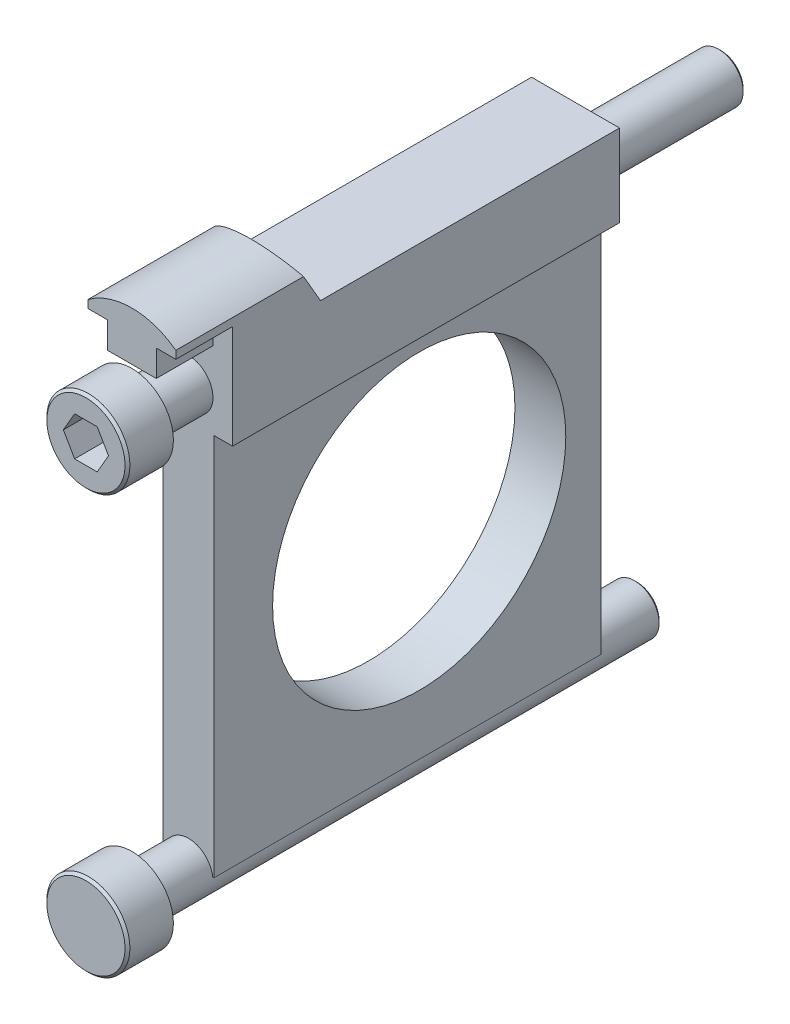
ISO-10303-21;
HEADER;
FILE_DESCRIPTION(('STEP AP214'),'2;1');
FILE_NAME('part.step','',(''),(''),'','','');
FILE_SCHEMA(('AUTOMOTIVE_DESIGN { 1 0 10303 214 1 1 1 1 }'));
ENDSEC;
DATA;
#1=APPLICATION_CONTEXT('core data for automotive mechanical design processes');
#2=APPLICATION_PROTOCOL_DEFINITION('international standard','automotive_design',2000,#1);
#3=PRODUCT_CONTEXT('',#1,'mechanical');
#4=PRODUCT('Part','Part','',(#3));
#5=PRODUCT_RELATED_PRODUCT_CATEGORY('part','',(#4));
#6=PRODUCT_DEFINITION_FORMATION('','',#4);
#7=PRODUCT_DEFINITION_CONTEXT('part definition',#1,'design');
#8=PRODUCT_DEFINITION('design','',#6,#7);
#9=PRODUCT_DEFINITION_SHAPE('','',#8);
#10=(LENGTH_UNIT() NAMED_UNIT(*) SI_UNIT(.MILLI.,.METRE.));
#11=(NAMED_UNIT(*) PLANE_ANGLE_UNIT() SI_UNIT($,.RADIAN.));
#12=(NAMED_UNIT(*) SI_UNIT($,.STERADIAN.) SOLID_ANGLE_UNIT());
#13=UNCERTAINTY_MEASURE_WITH_UNIT(LENGTH_MEASURE(1.E-05),#10,'distance_accuracy_value','');
#14=(GEOMETRIC_REPRESENTATION_CONTEXT(3) GLOBAL_UNCERTAINTY_ASSIGNED_CONTEXT((#13)) GLOBAL_UNIT_ASSIGNED_CONTEXT((#10,
#11,#12)) REPRESENTATION_CONTEXT('',''));
#15=CARTESIAN_POINT('',(0.,0.,0.));
#16=DIRECTION('',(0.,0.,1.));
#17=DIRECTION('',(1.,0.,0.));
#18=AXIS2_PLACEMENT_3D('',#15,#16,#17);
#19=CARTESIAN_POINT('',(2.6,-21.1,-18.6));
#20=DIRECTION('',(0.,0.,1.));
#21=DIRECTION('',(1.,0.,0.));
#22=AXIS2_PLACEMENT_3D('',#19,#20,#21);
#23=PLANE('',#22);
#24=CARTESIAN_POINT('',(0.,21.4,-18.6));
#25=DIRECTION('',(0.,0.,1.));
#26=DIRECTION('',(1.,0.,0.));
#27=AXIS2_PLACEMENT_3D('',#24,#25,#26);
#28=CIRCLE('',#27,2.5);
#29=CARTESIAN_POINT('',(2.5,21.4,-18.6));
#30=VERTEX_POINT('',#29);
#31=EDGE_CURVE('E273',#30,#30,#28,.F.);
#32=ORIENTED_EDGE('',*,*,#31,.F.);
#33=EDGE_LOOP('',(#32));
#34=FACE_BOUND('',#33,.T.);
#35=CARTESIAN_POINT('',(0.,-21.4,-18.6));
#36=DIRECTION('',(0.,0.,1.));
#37=DIRECTION('',(1.,0.,0.));
#38=AXIS2_PLACEMENT_3D('',#35,#36,#37);
#39=CIRCLE('',#38,2.5);
#40=CARTESIAN_POINT('',(-2.48193472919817,-21.1,-18.6));
#41=VERTEX_POINT('',#40);
#42=CARTESIAN_POINT('',(2.48193472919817,-21.1,-18.6));
#43=VERTEX_POINT('',#42);
#44=EDGE_CURVE('E261',#41,#43,#39,.F.);
#45=ORIENTED_EDGE('',*,*,#44,.F.);
#46=DIRECTION('',(-1.,0.,0.));
#47=VECTOR('',#46,1.);
#48=CARTESIAN_POINT('',(2.6,-21.1,-18.6));
#49=LINE('',#48,#47);
#50=CARTESIAN_POINT('',(-2.6,-21.1,-18.6));
#51=VERTEX_POINT('',#50);
#52=EDGE_CURVE('E380',#41,#51,#49,.T.);
#53=ORIENTED_EDGE('',*,*,#52,.T.);
#54=DIRECTION('',(0.,1.,0.));
#55=VECTOR('',#54,1.);
#56=CARTESIAN_POINT('',(-2.6,-21.1,-18.6));
#57=LINE('',#56,#55);
#58=CARTESIAN_POINT('',(-2.6,18.1,-18.6));
#59=VERTEX_POINT('',#58);
#60=EDGE_CURVE('E375',#51,#59,#57,.T.);
#61=ORIENTED_EDGE('',*,*,#60,.T.);
#62=DIRECTION('',(-1.,0.,0.));
#63=VECTOR('',#62,1.);
#64=CARTESIAN_POINT('',(4.5,18.1,-18.6));
#65=LINE('',#64,#63);
#66=CARTESIAN_POINT('',(-4.5,18.1,-18.6));
#67=VERTEX_POINT('',#66);
#68=EDGE_CURVE('E340',#59,#67,#65,.T.);
#69=ORIENTED_EDGE('',*,*,#68,.T.);
#70=DIRECTION('',(0.,1.,0.));
#71=VECTOR('',#70,1.);
#72=CARTESIAN_POINT('',(-4.5,18.1,-18.6));
#73=LINE('',#72,#71);
#74=CARTESIAN_POINT('',(-4.5,26.5,-18.6));
#75=VERTEX_POINT('',#74);
#76=EDGE_CURVE('E354',#67,#75,#73,.T.);
#77=ORIENTED_EDGE('',*,*,#76,.T.);
#78=DIRECTION('',(-1.,0.,0.));
#79=VECTOR('',#78,1.);
#80=CARTESIAN_POINT('',(90.3613690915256,26.5,-18.6));
#81=LINE('',#80,#79);
#82=CARTESIAN_POINT('',(4.5,26.5,-18.6));
#83=VERTEX_POINT('',#82);
#84=EDGE_CURVE('E328',#83,#75,#81,.T.);
#85=ORIENTED_EDGE('',*,*,#84,.F.);
#86=DIRECTION('',(0.,-1.,0.));
#87=VECTOR('',#86,1.);
#88=CARTESIAN_POINT('',(4.5,18.1,-18.6));
#89=LINE('',#88,#87);
#90=CARTESIAN_POINT('',(4.5,18.1,-18.6));
#91=VERTEX_POINT('',#90);
#92=EDGE_CURVE('E344',#83,#91,#89,.T.);
#93=ORIENTED_EDGE('',*,*,#92,.T.);
#94=CARTESIAN_POINT('',(2.6,18.1,-18.6));
#95=VERTEX_POINT('',#94);
#96=EDGE_CURVE('E351',#91,#95,#65,.T.);
#97=ORIENTED_EDGE('',*,*,#96,.T.);
#98=DIRECTION('',(0.,1.,0.));
#99=VECTOR('',#98,1.);
#100=CARTESIAN_POINT('',(2.6,-21.1,-18.6));
#101=LINE('',#100,#99);
#102=CARTESIAN_POINT('',(2.6,-21.1,-18.6));
#103=VERTEX_POINT('',#102);
#104=EDGE_CURVE('E377',#103,#95,#101,.T.);
#105=ORIENTED_EDGE('',*,*,#104,.F.);
#106=EDGE_CURVE('E388',#103,#43,#49,.T.);
#107=ORIENTED_EDGE('',*,*,#106,.T.);
#108=EDGE_LOOP('',(#45,#53,#61,#69,#77,#85,#93,#97,#105,#107));
#109=FACE_BOUND('',#108,.T.);
#110=ADVANCED_FACE('F34',(#34,#109),#23,.F.);
#111=CARTESIAN_POINT('',(2.6,-21.1,21.));
#112=DIRECTION('',(0.,0.,-1.));
#113=DIRECTION('',(-1.,0.,0.));
#114=AXIS2_PLACEMENT_3D('',#111,#112,#113);
#115=PLANE('',#114);
#116=CARTESIAN_POINT('',(0.,21.4,21.));
#117=DIRECTION('',(0.,0.,-1.));
#118=DIRECTION('',(-1.,0.,0.));
#119=AXIS2_PLACEMENT_3D('',#116,#117,#118);
#120=CIRCLE('',#119,2.5);
#121=CARTESIAN_POINT('',(-2.5,21.4,21.));
#122=VERTEX_POINT('',#121);
#123=EDGE_CURVE('E277',#122,#122,#120,.F.);
#124=ORIENTED_EDGE('',*,*,#123,.F.);
#125=EDGE_LOOP('',(#124));
#126=FACE_BOUND('',#125,.T.);
#127=CARTESIAN_POINT('',(0.,-21.4,21.));
#128=DIRECTION('',(0.,0.,-1.));
#129=DIRECTION('',(-1.,0.,0.));
#130=AXIS2_PLACEMENT_3D('',#127,#128,#129);
#131=CIRCLE('',#130,2.5);
#132=CARTESIAN_POINT('',(2.48193472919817,-21.1,21.));
#133=VERTEX_POINT('',#132);
#134=CARTESIAN_POINT('',(-2.48193472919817,-21.1,21.));
#135=VERTEX_POINT('',#134);
#136=EDGE_CURVE('E258',#133,#135,#131,.F.);
#137=ORIENTED_EDGE('',*,*,#136,.F.);
#138=DIRECTION('',(-1.,0.,0.));
#139=VECTOR('',#138,1.);
#140=CARTESIAN_POINT('',(2.6,-21.1,21.));
#141=LINE('',#140,#139);
#142=CARTESIAN_POINT('',(2.6,-21.1,21.));
#143=VERTEX_POINT('',#142);
#144=EDGE_CURVE('E392',#143,#133,#141,.T.);
#145=ORIENTED_EDGE('',*,*,#144,.F.);
#146=DIRECTION('',(0.,-1.,0.));
#147=VECTOR('',#146,1.);
#148=CARTESIAN_POINT('',(2.6,-21.1,21.));
#149=LINE('',#148,#147);
#150=CARTESIAN_POINT('',(2.6,18.1,21.));
#151=VERTEX_POINT('',#150);
#152=EDGE_CURVE('E372',#151,#143,#149,.T.);
#153=ORIENTED_EDGE('',*,*,#152,.F.);
#154=DIRECTION('',(1.,0.,0.));
#155=VECTOR('',#154,1.);
#156=CARTESIAN_POINT('',(-4.5,18.1,21.));
#157=LINE('',#156,#155);
#158=CARTESIAN_POINT('',(4.5,18.1,21.));
#159=VERTEX_POINT('',#158);
#160=EDGE_CURVE('E299',#151,#159,#157,.T.);
#161=ORIENTED_EDGE('',*,*,#160,.T.);
#162=DIRECTION('',(0.,1.,0.));
#163=VECTOR('',#162,1.);
#164=CARTESIAN_POINT('',(4.5,28.7,21.));
#165=LINE('',#164,#163);
#166=CARTESIAN_POINT('',(4.5,28.7,21.));
#167=VERTEX_POINT('',#166);
#168=EDGE_CURVE('E302',#159,#167,#165,.T.);
#169=ORIENTED_EDGE('',*,*,#168,.T.);
#170=DIRECTION('',(-1.,0.,0.));
#171=VECTOR('',#170,1.);
#172=CARTESIAN_POINT('',(4.5,28.7,21.));
#173=LINE('',#172,#171);
#174=CARTESIAN_POINT('',(2.5,28.7,21.));
#175=VERTEX_POINT('',#174);
#176=EDGE_CURVE('E304',#167,#175,#173,.T.);
#177=ORIENTED_EDGE('',*,*,#176,.T.);
#178=DIRECTION('',(0.,-1.,0.));
#179=VECTOR('',#178,1.);
#180=CARTESIAN_POINT('',(2.5,28.7,21.));
#181=LINE('',#180,#179);
#182=CARTESIAN_POINT('',(2.5,26.,21.));
#183=VERTEX_POINT('',#182);
#184=EDGE_CURVE('E306',#175,#183,#181,.T.);
#185=ORIENTED_EDGE('',*,*,#184,.T.);
#186=DIRECTION('',(-1.,0.,0.));
#187=VECTOR('',#186,1.);
#188=CARTESIAN_POINT('',(-2.5,26.,21.));
#189=LINE('',#188,#187);
#190=CARTESIAN_POINT('',(-2.5,26.,21.));
#191=VERTEX_POINT('',#190);
#192=EDGE_CURVE('E308',#183,#191,#189,.T.);
#193=ORIENTED_EDGE('',*,*,#192,.T.);
#194=DIRECTION('',(0.,1.,0.));
#195=VECTOR('',#194,1.);
#196=CARTESIAN_POINT('',(-2.5,28.7,21.));
#197=LINE('',#196,#195);
#198=CARTESIAN_POINT('',(-2.5,28.7,21.));
#199=VERTEX_POINT('',#198);
#200=EDGE_CURVE('E285',#191,#199,#197,.T.);
#201=ORIENTED_EDGE('',*,*,#200,.T.);
#202=DIRECTION('',(-1.,0.,0.));
#203=VECTOR('',#202,1.);
#204=CARTESIAN_POINT('',(-4.5,28.7,21.));
#205=LINE('',#204,#203);
#206=CARTESIAN_POINT('',(-4.5,28.7,21.));
#207=VERTEX_POINT('',#206);
#208=EDGE_CURVE('E281',#199,#207,#205,.T.);
#209=ORIENTED_EDGE('',*,*,#208,.T.);
#210=DIRECTION('',(0.,-1.,0.));
#211=VECTOR('',#210,1.);
#212=CARTESIAN_POINT('',(-4.5,28.7,21.));
#213=LINE('',#212,#211);
#214=CARTESIAN_POINT('',(-4.5,18.1,21.));
#215=VERTEX_POINT('',#214);
#216=EDGE_CURVE('E297',#207,#215,#213,.T.);
#217=ORIENTED_EDGE('',*,*,#216,.T.);
#218=CARTESIAN_POINT('',(-2.6,18.1,21.));
#219=VERTEX_POINT('',#218);
#220=EDGE_CURVE('E300',#215,#219,#157,.T.);
#221=ORIENTED_EDGE('',*,*,#220,.T.);
#222=DIRECTION('',(0.,-1.,0.));
#223=VECTOR('',#222,1.);
#224=CARTESIAN_POINT('',(-2.6,-21.1,21.));
#225=LINE('',#224,#223);
#226=CARTESIAN_POINT('',(-2.6,-21.1,21.));
#227=VERTEX_POINT('',#226);
#228=EDGE_CURVE('E371',#219,#227,#225,.T.);
#229=ORIENTED_EDGE('',*,*,#228,.T.);
#230=EDGE_CURVE('E391',#135,#227,#141,.T.);
#231=ORIENTED_EDGE('',*,*,#230,.F.);
#232=EDGE_LOOP('',(#137,#145,#153,#161,#169,#177,#185,#193,#201,#209,#217,#221,#229,#231));
#233=FACE_BOUND('',#232,.T.);
#234=ADVANCED_FACE('F451',(#126,#233),#115,.F.);
#235=CARTESIAN_POINT('',(2.6,-21.1,21.));
#236=DIRECTION('',(0.,1.,0.));
#237=DIRECTION('',(0.,0.,1.));
#238=AXIS2_PLACEMENT_3D('',#235,#236,#237);
#239=PLANE('',#238);
#240=DIRECTION('',(0.,0.,1.));
#241=VECTOR('',#240,1.);
#242=CARTESIAN_POINT('',(-2.48193472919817,-21.1,32.924648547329));
#243=LINE('',#242,#241);
#244=EDGE_CURVE('E57',#135,#41,#243,.F.);
#245=ORIENTED_EDGE('',*,*,#244,.F.);
#246=ORIENTED_EDGE('',*,*,#230,.T.);
#247=DIRECTION('',(0.,0.,-1.));
#248=VECTOR('',#247,1.);
#249=CARTESIAN_POINT('',(-2.6,-21.1,21.));
#250=LINE('',#249,#248);
#251=EDGE_CURVE('E383',#227,#51,#250,.T.);
#252=ORIENTED_EDGE('',*,*,#251,.T.);
#253=ORIENTED_EDGE('',*,*,#52,.F.);
#254=EDGE_LOOP('',(#245,#246,#252,#253));
#255=FACE_BOUND('',#254,.T.);
#256=ADVANCED_FACE('F457',(#255),#239,.F.);
#257=DIRECTION('',(0.,0.,1.));
#258=VECTOR('',#257,1.);
#259=CARTESIAN_POINT('',(2.48193472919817,-21.1,32.924648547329));
#260=LINE('',#259,#258);
#261=EDGE_CURVE('E276',#43,#133,#260,.T.);
#262=ORIENTED_EDGE('',*,*,#261,.F.);
#263=ORIENTED_EDGE('',*,*,#106,.F.);
#264=DIRECTION('',(0.,0.,-1.));
#265=VECTOR('',#264,1.);
#266=CARTESIAN_POINT('',(2.6,-21.1,21.));
#267=LINE('',#266,#265);
#268=EDGE_CURVE('E374',#143,#103,#267,.T.);
#269=ORIENTED_EDGE('',*,*,#268,.F.);
#270=ORIENTED_EDGE('',*,*,#144,.T.);
#271=EDGE_LOOP('',(#262,#263,#269,#270));
#272=FACE_BOUND('',#271,.T.);
#273=ADVANCED_FACE('F467',(#272),#239,.F.);
#274=CARTESIAN_POINT('',(4.5,18.1,26.8));
#275=DIRECTION('',(1.,0.,0.));
#276=DIRECTION('',(0.,1.,0.));
#277=AXIS2_PLACEMENT_3D('',#274,#275,#276);
#278=PLANE('',#277);
#279=DIRECTION('',(0.,-1.,0.));
#280=VECTOR('',#279,1.);
#281=CARTESIAN_POINT('',(4.5,18.1,26.8));
#282=LINE('',#281,#280);
#283=CARTESIAN_POINT('',(4.5,29.5,26.8));
#284=VERTEX_POINT('',#283);
#285=CARTESIAN_POINT('',(4.5,28.7,26.8));
#286=VERTEX_POINT('',#285);
#287=EDGE_CURVE('E347',#284,#286,#282,.T.);
#288=ORIENTED_EDGE('',*,*,#287,.T.);
#289=DIRECTION('',(0.,0.,-1.));
#290=VECTOR('',#289,1.);
#291=CARTESIAN_POINT('',(4.5,28.7,26.8));
#292=LINE('',#291,#290);
#293=EDGE_CURVE('E322',#286,#167,#292,.T.);
#294=ORIENTED_EDGE('',*,*,#293,.T.);
#295=ORIENTED_EDGE('',*,*,#168,.F.);
#296=DIRECTION('',(0.,0.,-1.));
#297=VECTOR('',#296,1.);
#298=CARTESIAN_POINT('',(4.5,18.1,26.8));
#299=LINE('',#298,#297);
#300=EDGE_CURVE('E359',#159,#91,#299,.T.);
#301=ORIENTED_EDGE('',*,*,#300,.T.);
#302=ORIENTED_EDGE('',*,*,#92,.F.);
#303=DIRECTION('',(0.,0.,1.));
#304=VECTOR('',#303,1.);
#305=CARTESIAN_POINT('',(4.5,26.5,26.8));
#306=LINE('',#305,#304);
#307=CARTESIAN_POINT('',(4.5,26.5,12.));
#308=VERTEX_POINT('',#307);
#309=EDGE_CURVE('E330',#83,#308,#306,.T.);
#310=ORIENTED_EDGE('',*,*,#309,.T.);
#311=DIRECTION('',(0.,0.86602540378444,0.499999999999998));
#312=VECTOR('',#311,1.);
#313=CARTESIAN_POINT('',(4.5,26.6085879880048,12.0626933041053));
#314=LINE('',#313,#312);
#315=CARTESIAN_POINT('',(4.5,29.5,13.7320508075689));
#316=VERTEX_POINT('',#315);
#317=EDGE_CURVE('E337',#308,#316,#314,.T.);
#318=ORIENTED_EDGE('',*,*,#317,.T.);
#319=DIRECTION('',(0.,0.,-1.));
#320=VECTOR('',#319,1.);
#321=CARTESIAN_POINT('',(4.5,29.5,26.8));
#322=LINE('',#321,#320);
#323=EDGE_CURVE('E362',#284,#316,#322,.T.);
#324=ORIENTED_EDGE('',*,*,#323,.F.);
#325=EDGE_LOOP('',(#288,#294,#295,#301,#302,#310,#318,#324));
#326=FACE_BOUND('',#325,.T.);
#327=ADVANCED_FACE('F562',(#326),#278,.T.);
#328=CARTESIAN_POINT('',(-4.5,18.1,26.8));
#329=DIRECTION('',(-1.,0.,0.));
#330=DIRECTION('',(0.,-1.,0.));
#331=AXIS2_PLACEMENT_3D('',#328,#329,#330);
#332=PLANE('',#331);
#333=ORIENTED_EDGE('',*,*,#216,.F.);
#334=DIRECTION('',(0.,0.,-1.));
#335=VECTOR('',#334,1.);
#336=CARTESIAN_POINT('',(-4.5,28.7,26.8));
#337=LINE('',#336,#335);
#338=CARTESIAN_POINT('',(-4.5,28.7,26.8));
#339=VERTEX_POINT('',#338);
#340=EDGE_CURVE('E325',#339,#207,#337,.T.);
#341=ORIENTED_EDGE('',*,*,#340,.F.);
#342=DIRECTION('',(0.,1.,0.));
#343=VECTOR('',#342,1.);
#344=CARTESIAN_POINT('',(-4.5,18.1,26.8));
#345=LINE('',#344,#343);
#346=CARTESIAN_POINT('',(-4.5,29.5,26.8));
#347=VERTEX_POINT('',#346);
#348=EDGE_CURVE('E341',#339,#347,#345,.T.);
#349=ORIENTED_EDGE('',*,*,#348,.T.);
#350=DIRECTION('',(0.,0.,-1.));
#351=VECTOR('',#350,1.);
#352=CARTESIAN_POINT('',(-4.5,29.5,26.8));
#353=LINE('',#352,#351);
#354=CARTESIAN_POINT('',(-4.5,29.5,13.7320508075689));
#355=VERTEX_POINT('',#354);
#356=EDGE_CURVE('E365',#347,#355,#353,.T.);
#357=ORIENTED_EDGE('',*,*,#356,.T.);
#358=DIRECTION('',(0.,-0.86602540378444,-0.499999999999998));
#359=VECTOR('',#358,1.);
#360=CARTESIAN_POINT('',(-4.5,26.6085879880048,12.0626933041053));
#361=LINE('',#360,#359);
#362=CARTESIAN_POINT('',(-4.5,26.5,12.));
#363=VERTEX_POINT('',#362);
#364=EDGE_CURVE('E400',#355,#363,#361,.T.);
#365=ORIENTED_EDGE('',*,*,#364,.T.);
#366=DIRECTION('',(0.,0.,-1.));
#367=VECTOR('',#366,1.);
#368=CARTESIAN_POINT('',(-4.5,26.5,26.8));
#369=LINE('',#368,#367);
#370=EDGE_CURVE('E397',#363,#75,#369,.T.);
#371=ORIENTED_EDGE('',*,*,#370,.T.);
#372=ORIENTED_EDGE('',*,*,#76,.F.);
#373=DIRECTION('',(0.,0.,-1.));
#374=VECTOR('',#373,1.);
#375=CARTESIAN_POINT('',(-4.5,18.1,26.8));
#376=LINE('',#375,#374);
#377=EDGE_CURVE('E350',#215,#67,#376,.T.);
#378=ORIENTED_EDGE('',*,*,#377,.F.);
#379=EDGE_LOOP('',(#333,#341,#349,#357,#365,#371,#372,#378));
#380=FACE_BOUND('',#379,.T.);
#381=ADVANCED_FACE('F565',(#380),#332,.T.);
#382=CARTESIAN_POINT('',(4.5,18.1,26.8));
#383=DIRECTION('',(0.,-1.,0.));
#384=DIRECTION('',(0.,0.,-1.));
#385=AXIS2_PLACEMENT_3D('',#382,#383,#384);
#386=PLANE('',#385);
#387=ORIENTED_EDGE('',*,*,#220,.F.);
#388=ORIENTED_EDGE('',*,*,#377,.T.);
#389=ORIENTED_EDGE('',*,*,#68,.F.);
#390=DIRECTION('',(0.,0.,1.));
#391=VECTOR('',#390,1.);
#392=CARTESIAN_POINT('',(-2.6,18.1,21.));
#393=LINE('',#392,#391);
#394=EDGE_CURVE('E394',#59,#219,#393,.T.);
#395=ORIENTED_EDGE('',*,*,#394,.T.);
#396=EDGE_LOOP('',(#387,#388,#389,#395));
#397=FACE_BOUND('',#396,.T.);
#398=ADVANCED_FACE('F560',(#397),#386,.T.);
#399=CARTESIAN_POINT('',(0.,23.5,26.8));
#400=DIRECTION('',(0.,0.,1.));
#401=DIRECTION('',(1.,0.,0.));
#402=AXIS2_PLACEMENT_3D('',#399,#400,#401);
#403=PLANE('',#402);
#404=ORIENTED_EDGE('',*,*,#348,.F.);
#405=DIRECTION('',(-1.,0.,0.));
#406=VECTOR('',#405,1.);
#407=CARTESIAN_POINT('',(-4.5,28.7,26.8));
#408=LINE('',#407,#406);
#409=CARTESIAN_POINT('',(-2.5,28.7,26.8));
#410=VERTEX_POINT('',#409);
#411=EDGE_CURVE('E282',#410,#339,#408,.T.);
#412=ORIENTED_EDGE('',*,*,#411,.F.);
#413=DIRECTION('',(0.,1.,0.));
#414=VECTOR('',#413,1.);
#415=CARTESIAN_POINT('',(-2.5,28.7,26.8));
#416=LINE('',#415,#414);
#417=CARTESIAN_POINT('',(-2.5,26.,26.8));
#418=VERTEX_POINT('',#417);
#419=EDGE_CURVE('E292',#418,#410,#416,.T.);
#420=ORIENTED_EDGE('',*,*,#419,.F.);
#421=DIRECTION('',(-1.,0.,0.));
#422=VECTOR('',#421,1.);
#423=CARTESIAN_POINT('',(-2.5,26.,26.8));
#424=LINE('',#423,#422);
#425=CARTESIAN_POINT('',(2.5,26.,26.8));
#426=VERTEX_POINT('',#425);
#427=EDGE_CURVE('E289',#426,#418,#424,.T.);
#428=ORIENTED_EDGE('',*,*,#427,.F.);
#429=DIRECTION('',(0.,-1.,0.));
#430=VECTOR('',#429,1.);
#431=CARTESIAN_POINT('',(2.5,28.7,26.8));
#432=LINE('',#431,#430);
#433=CARTESIAN_POINT('',(2.5,28.7,26.8));
#434=VERTEX_POINT('',#433);
#435=EDGE_CURVE('E287',#434,#426,#432,.T.);
#436=ORIENTED_EDGE('',*,*,#435,.F.);
#437=DIRECTION('',(-1.,0.,0.));
#438=VECTOR('',#437,1.);
#439=CARTESIAN_POINT('',(4.5,28.7,26.8));
#440=LINE('',#439,#438);
#441=EDGE_CURVE('E284',#286,#434,#440,.T.);
#442=ORIENTED_EDGE('',*,*,#441,.F.);
#443=ORIENTED_EDGE('',*,*,#287,.F.);
#444=CARTESIAN_POINT('',(0.,23.5,26.8));
#445=DIRECTION('',(0.,0.,-1.));
#446=DIRECTION('',(1.,0.,0.));
#447=AXIS2_PLACEMENT_3D('',#444,#445,#446);
#448=CIRCLE('',#447,7.5);
#449=EDGE_CURVE('E343',#347,#284,#448,.T.);
#450=ORIENTED_EDGE('',*,*,#449,.F.);
#451=EDGE_LOOP('',(#404,#412,#420,#428,#436,#442,#443,#450));
#452=FACE_BOUND('',#451,.T.);
#453=ADVANCED_FACE('F556',(#452),#403,.T.);
#454=CARTESIAN_POINT('',(0.,23.5,26.8));
#455=DIRECTION('',(0.,0.,-1.));
#456=DIRECTION('',(-1.,0.,0.));
#457=AXIS2_PLACEMENT_3D('',#454,#455,#456);
#458=CYLINDRICAL_SURFACE('',#457,7.5);
#459=ORIENTED_EDGE('',*,*,#323,.T.);
#460=CARTESIAN_POINT('',(0.,23.5,10.2679491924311));
#461=DIRECTION('',(0.,0.499999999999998,-0.86602540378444));
#462=DIRECTION('',(0.,-0.86602540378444,-0.499999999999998));
#463=AXIS2_PLACEMENT_3D('',#460,#461,#462);
#464=ELLIPSE('',#463,8.66025403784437,7.5);
#465=EDGE_CURVE('E335',#316,#355,#464,.F.);
#466=ORIENTED_EDGE('',*,*,#465,.T.);
#467=ORIENTED_EDGE('',*,*,#356,.F.);
#468=ORIENTED_EDGE('',*,*,#449,.T.);
#469=EDGE_LOOP('',(#459,#466,#467,#468));
#470=FACE_BOUND('',#469,.T.);
#471=ADVANCED_FACE('F559',(#470),#458,.T.);
#472=CARTESIAN_POINT('',(2.6,26.5,21.));
#473=DIRECTION('',(-1.,0.,0.));
#474=DIRECTION('',(0.,0.,1.));
#475=AXIS2_PLACEMENT_3D('',#472,#473,#474);
#476=PLANE('',#475);
#477=CARTESIAN_POINT('',(2.6,0.,0.));
#478=DIRECTION('',(-1.,0.,0.));
#479=DIRECTION('',(0.,0.,1.));
#480=AXIS2_PLACEMENT_3D('',#477,#478,#479);
#481=CIRCLE('',#480,15.);
#482=CARTESIAN_POINT('',(2.6,0.,15.));
#483=VERTEX_POINT('',#482);
#484=EDGE_CURVE('E278',#483,#483,#481,.T.);
#485=ORIENTED_EDGE('',*,*,#484,.T.);
#486=EDGE_LOOP('',(#485));
#487=FACE_BOUND('',#486,.T.);
#488=ORIENTED_EDGE('',*,*,#104,.T.);
#489=DIRECTION('',(0.,0.,1.));
#490=VECTOR('',#489,1.);
#491=CARTESIAN_POINT('',(2.6,18.1,21.));
#492=LINE('',#491,#490);
#493=EDGE_CURVE('E361',#95,#151,#492,.T.);
#494=ORIENTED_EDGE('',*,*,#493,.T.);
#495=ORIENTED_EDGE('',*,*,#152,.T.);
#496=ORIENTED_EDGE('',*,*,#268,.T.);
#497=EDGE_LOOP('',(#488,#494,#495,#496));
#498=FACE_BOUND('',#497,.T.);
#499=ADVANCED_FACE('F569',(#487,#498),#476,.F.);
#500=CARTESIAN_POINT('',(-2.6,26.5,21.));
#501=DIRECTION('',(-1.,0.,0.));
#502=DIRECTION('',(0.,0.,1.));
#503=AXIS2_PLACEMENT_3D('',#500,#501,#502);
#504=PLANE('',#503);
#505=CARTESIAN_POINT('',(-2.6,0.,0.));
#506=DIRECTION('',(-1.,0.,0.));
#507=DIRECTION('',(0.,0.,1.));
#508=AXIS2_PLACEMENT_3D('',#505,#506,#507);
#509=CIRCLE('',#508,15.);
#510=CARTESIAN_POINT('',(-2.6,0.,15.));
#511=VERTEX_POINT('',#510);
#512=EDGE_CURVE('E272',#511,#511,#509,.T.);
#513=ORIENTED_EDGE('',*,*,#512,.F.);
#514=EDGE_LOOP('',(#513));
#515=FACE_BOUND('',#514,.T.);
#516=ORIENTED_EDGE('',*,*,#394,.F.);
#517=ORIENTED_EDGE('',*,*,#60,.F.);
#518=ORIENTED_EDGE('',*,*,#251,.F.);
#519=ORIENTED_EDGE('',*,*,#228,.F.);
#520=EDGE_LOOP('',(#516,#517,#518,#519));
#521=FACE_BOUND('',#520,.T.);
#522=ADVANCED_FACE('F464',(#515,#521),#504,.T.);
#523=ORIENTED_EDGE('',*,*,#160,.F.);
#524=ORIENTED_EDGE('',*,*,#493,.F.);
#525=ORIENTED_EDGE('',*,*,#96,.F.);
#526=ORIENTED_EDGE('',*,*,#300,.F.);
#527=EDGE_LOOP('',(#523,#524,#525,#526));
#528=FACE_BOUND('',#527,.T.);
#529=ADVANCED_FACE('F554',(#528),#386,.T.);
#530=CARTESIAN_POINT('',(90.3613690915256,31.,14.5980762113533));
#531=DIRECTION('',(0.,0.499999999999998,-0.86602540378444));
#532=DIRECTION('',(0.,0.86602540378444,0.499999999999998));
#533=AXIS2_PLACEMENT_3D('',#530,#531,#532);
#534=PLANE('',#533);
#535=ORIENTED_EDGE('',*,*,#317,.F.);
#536=DIRECTION('',(-1.,0.,0.));
#537=VECTOR('',#536,1.);
#538=CARTESIAN_POINT('',(90.3613690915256,26.5,12.));
#539=LINE('',#538,#537);
#540=EDGE_CURVE('E327',#308,#363,#539,.T.);
#541=ORIENTED_EDGE('',*,*,#540,.T.);
#542=ORIENTED_EDGE('',*,*,#364,.F.);
#543=ORIENTED_EDGE('',*,*,#465,.F.);
#544=EDGE_LOOP('',(#535,#541,#542,#543));
#545=FACE_BOUND('',#544,.T.);
#546=ADVANCED_FACE('F550',(#545),#534,.T.);
#547=CARTESIAN_POINT('',(90.3613690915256,26.5,12.));
#548=DIRECTION('',(0.,1.,0.));
#549=DIRECTION('',(0.,0.,1.));
#550=AXIS2_PLACEMENT_3D('',#547,#548,#549);
#551=PLANE('',#550);
#552=ORIENTED_EDGE('',*,*,#309,.F.);
#553=ORIENTED_EDGE('',*,*,#84,.T.);
#554=ORIENTED_EDGE('',*,*,#370,.F.);
#555=ORIENTED_EDGE('',*,*,#540,.F.);
#556=EDGE_LOOP('',(#552,#553,#554,#555));
#557=FACE_BOUND('',#556,.T.);
#558=ADVANCED_FACE('F546',(#557),#551,.T.);
#559=CARTESIAN_POINT('',(-4.5,28.7,26.8));
#560=DIRECTION('',(0.,-1.,0.));
#561=DIRECTION('',(1.,0.,0.));
#562=AXIS2_PLACEMENT_3D('',#559,#560,#561);
#563=PLANE('',#562);
#564=ORIENTED_EDGE('',*,*,#208,.F.);
#565=DIRECTION('',(0.,0.,-1.));
#566=VECTOR('',#565,1.);
#567=CARTESIAN_POINT('',(-2.5,28.7,26.8));
#568=LINE('',#567,#566);
#569=EDGE_CURVE('E294',#410,#199,#568,.T.);
#570=ORIENTED_EDGE('',*,*,#569,.F.);
#571=ORIENTED_EDGE('',*,*,#411,.T.);
#572=ORIENTED_EDGE('',*,*,#340,.T.);
#573=EDGE_LOOP('',(#564,#570,#571,#572));
#574=FACE_BOUND('',#573,.T.);
#575=ADVANCED_FACE('F542',(#574),#563,.T.);
#576=CARTESIAN_POINT('',(4.5,28.7,26.8));
#577=DIRECTION('',(0.,-1.,0.));
#578=DIRECTION('',(1.,0.,0.));
#579=AXIS2_PLACEMENT_3D('',#576,#577,#578);
#580=PLANE('',#579);
#581=ORIENTED_EDGE('',*,*,#176,.F.);
#582=ORIENTED_EDGE('',*,*,#293,.F.);
#583=ORIENTED_EDGE('',*,*,#441,.T.);
#584=DIRECTION('',(0.,0.,-1.));
#585=VECTOR('',#584,1.);
#586=CARTESIAN_POINT('',(2.5,28.7,26.8));
#587=LINE('',#586,#585);
#588=EDGE_CURVE('E319',#434,#175,#587,.T.);
#589=ORIENTED_EDGE('',*,*,#588,.T.);
#590=EDGE_LOOP('',(#581,#582,#583,#589));
#591=FACE_BOUND('',#590,.T.);
#592=ADVANCED_FACE('F538',(#591),#580,.T.);
#593=CARTESIAN_POINT('',(2.5,28.7,26.8));
#594=DIRECTION('',(1.,0.,0.));
#595=DIRECTION('',(0.,0.,-1.));
#596=AXIS2_PLACEMENT_3D('',#593,#594,#595);
#597=PLANE('',#596);
#598=ORIENTED_EDGE('',*,*,#184,.F.);
#599=ORIENTED_EDGE('',*,*,#588,.F.);
#600=ORIENTED_EDGE('',*,*,#435,.T.);
#601=DIRECTION('',(0.,0.,-1.));
#602=VECTOR('',#601,1.);
#603=CARTESIAN_POINT('',(2.5,26.,26.8));
#604=LINE('',#603,#602);
#605=EDGE_CURVE('E316',#426,#183,#604,.T.);
#606=ORIENTED_EDGE('',*,*,#605,.T.);
#607=EDGE_LOOP('',(#598,#599,#600,#606));
#608=FACE_BOUND('',#607,.T.);
#609=ADVANCED_FACE('F534',(#608),#597,.T.);
#610=CARTESIAN_POINT('',(-2.5,26.,26.8));
#611=DIRECTION('',(0.,-1.,0.));
#612=DIRECTION('',(0.,0.,-1.));
#613=AXIS2_PLACEMENT_3D('',#610,#611,#612);
#614=PLANE('',#613);
#615=ORIENTED_EDGE('',*,*,#192,.F.);
#616=ORIENTED_EDGE('',*,*,#605,.F.);
#617=ORIENTED_EDGE('',*,*,#427,.T.);
#618=DIRECTION('',(0.,0.,-1.));
#619=VECTOR('',#618,1.);
#620=CARTESIAN_POINT('',(-2.5,26.,26.8));
#621=LINE('',#620,#619);
#622=EDGE_CURVE('E313',#418,#191,#621,.T.);
#623=ORIENTED_EDGE('',*,*,#622,.T.);
#624=EDGE_LOOP('',(#615,#616,#617,#623));
#625=FACE_BOUND('',#624,.T.);
#626=ADVANCED_FACE('F530',(#625),#614,.T.);
#627=CARTESIAN_POINT('',(-2.5,28.7,26.8));
#628=DIRECTION('',(-1.,0.,0.));
#629=DIRECTION('',(0.,0.,1.));
#630=AXIS2_PLACEMENT_3D('',#627,#628,#629);
#631=PLANE('',#630);
#632=ORIENTED_EDGE('',*,*,#200,.F.);
#633=ORIENTED_EDGE('',*,*,#622,.F.);
#634=ORIENTED_EDGE('',*,*,#419,.T.);
#635=ORIENTED_EDGE('',*,*,#569,.T.);
#636=EDGE_LOOP('',(#632,#633,#634,#635));
#637=FACE_BOUND('',#636,.T.);
#638=ADVANCED_FACE('F526',(#637),#631,.T.);
#639=CARTESIAN_POINT('',(-4.5,0.,0.));
#640=DIRECTION('',(1.,0.,0.));
#641=DIRECTION('',(0.,0.,-1.));
#642=AXIS2_PLACEMENT_3D('',#639,#640,#641);
#643=CYLINDRICAL_SURFACE('',#642,15.);
#644=ORIENTED_EDGE('',*,*,#512,.T.);
#645=EDGE_LOOP('',(#644));
#646=FACE_BOUND('',#645,.T.);
#647=ORIENTED_EDGE('',*,*,#484,.F.);
#648=EDGE_LOOP('',(#647));
#649=FACE_BOUND('',#648,.T.);
#650=ADVANCED_FACE('F515',(#646,#649),#643,.F.);
#651=CARTESIAN_POINT('',(0.,25.65,26.8));
#652=DIRECTION('',(0.,0.,1.));
#653=DIRECTION('',(1.,0.,0.));
#654=AXIS2_PLACEMENT_3D('',#651,#652,#653);
#655=PLANE('',#654);
#656=CARTESIAN_POINT('',(0.,21.4,26.8));
#657=DIRECTION('',(0.,0.,1.));
#658=DIRECTION('',(1.,0.,0.));
#659=AXIS2_PLACEMENT_3D('',#656,#657,#658);
#660=CIRCLE('',#659,4.25);
#661=CARTESIAN_POINT('',(4.25,21.4,26.8));
#662=VERTEX_POINT('',#661);
#663=EDGE_CURVE('E268',#662,#662,#660,.T.);
#664=ORIENTED_EDGE('',*,*,#663,.F.);
#665=EDGE_LOOP('',(#664));
#666=FACE_BOUND('',#665,.T.);
#667=CARTESIAN_POINT('',(0.,21.4,26.8));
#668=DIRECTION('',(0.,0.,1.));
#669=DIRECTION('',(1.,0.,0.));
#670=AXIS2_PLACEMENT_3D('',#667,#668,#669);
#671=CIRCLE('',#670,2.5);
#672=CARTESIAN_POINT('',(2.5,21.4,26.8));
#673=VERTEX_POINT('',#672);
#674=EDGE_CURVE('E264',#673,#673,#671,.T.);
#675=ORIENTED_EDGE('',*,*,#674,.T.);
#676=EDGE_LOOP('',(#675));
#677=FACE_BOUND('',#676,.T.);
#678=ADVANCED_FACE('F511',(#666,#677),#655,.F.);
#679=CARTESIAN_POINT('',(0.,21.4,35.1513840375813));
#680=DIRECTION('',(0.,0.,1.));
#681=DIRECTION('',(1.,0.,0.));
#682=AXIS2_PLACEMENT_3D('',#679,#680,#681);
#683=CYLINDRICAL_SURFACE('',#682,4.25);
#684=CARTESIAN_POINT('',(0.,21.4,31.25));
#685=DIRECTION('',(0.,0.,-1.));
#686=DIRECTION('',(-1.,0.,0.));
#687=AXIS2_PLACEMENT_3D('',#684,#685,#686);
#688=CIRCLE('',#687,4.25);
#689=CARTESIAN_POINT('',(-4.25,21.4,31.25));
#690=VERTEX_POINT('',#689);
#691=EDGE_CURVE('E415',#690,#690,#688,.T.);
#692=ORIENTED_EDGE('',*,*,#691,.T.);
#693=EDGE_LOOP('',(#692));
#694=FACE_BOUND('',#693,.T.);
#695=ORIENTED_EDGE('',*,*,#663,.T.);
#696=EDGE_LOOP('',(#695));
#697=FACE_BOUND('',#696,.T.);
#698=ADVANCED_FACE('F514',(#694,#697),#683,.T.);
#699=CARTESIAN_POINT('',(0.,21.4,31.5));
#700=DIRECTION('',(0.,0.,-1.));
#701=DIRECTION('',(-1.,0.,0.));
#702=AXIS2_PLACEMENT_3D('',#699,#700,#701);
#703=PLANE('',#702);
#704=DIRECTION('',(0.5,0.866025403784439,0.));
#705=VECTOR('',#704,1.);
#706=CARTESIAN_POINT('',(1.15470053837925,19.4,31.5));
#707=LINE('',#706,#705);
#708=CARTESIAN_POINT('',(1.15470053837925,19.4,31.5));
#709=VERTEX_POINT('',#708);
#710=CARTESIAN_POINT('',(2.3094010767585,21.4,31.5));
#711=VERTEX_POINT('',#710);
#712=EDGE_CURVE('E231',#709,#711,#707,.T.);
#713=ORIENTED_EDGE('',*,*,#712,.F.);
#714=DIRECTION('',(1.,0.,0.));
#715=VECTOR('',#714,1.);
#716=CARTESIAN_POINT('',(-1.15470053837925,19.4,31.5));
#717=LINE('',#716,#715);
#718=CARTESIAN_POINT('',(-1.15470053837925,19.4,31.5));
#719=VERTEX_POINT('',#718);
#720=EDGE_CURVE('E49',#719,#709,#717,.T.);
#721=ORIENTED_EDGE('',*,*,#720,.F.);
#722=DIRECTION('',(0.5,-0.866025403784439,0.));
#723=VECTOR('',#722,1.);
#724=CARTESIAN_POINT('',(-2.3094010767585,21.4,31.5));
#725=LINE('',#724,#723);
#726=CARTESIAN_POINT('',(-2.3094010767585,21.4,31.5));
#727=VERTEX_POINT('',#726);
#728=EDGE_CURVE('E217',#727,#719,#725,.T.);
#729=ORIENTED_EDGE('',*,*,#728,.F.);
#730=DIRECTION('',(-0.5,-0.866025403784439,0.));
#731=VECTOR('',#730,1.);
#732=CARTESIAN_POINT('',(-1.15470053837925,23.4,31.5));
#733=LINE('',#732,#731);
#734=CARTESIAN_POINT('',(-1.15470053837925,23.4,31.5));
#735=VERTEX_POINT('',#734);
#736=EDGE_CURVE('E220',#735,#727,#733,.T.);
#737=ORIENTED_EDGE('',*,*,#736,.F.);
#738=DIRECTION('',(-1.,0.,0.));
#739=VECTOR('',#738,1.);
#740=CARTESIAN_POINT('',(1.15470053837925,23.4,31.5));
#741=LINE('',#740,#739);
#742=CARTESIAN_POINT('',(1.15470053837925,23.4,31.5));
#743=VERTEX_POINT('',#742);
#744=EDGE_CURVE('E236',#743,#735,#741,.T.);
#745=ORIENTED_EDGE('',*,*,#744,.F.);
#746=DIRECTION('',(-0.5,0.866025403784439,0.));
#747=VECTOR('',#746,1.);
#748=CARTESIAN_POINT('',(2.3094010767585,21.4,31.5));
#749=LINE('',#748,#747);
#750=EDGE_CURVE('E233',#711,#743,#749,.T.);
#751=ORIENTED_EDGE('',*,*,#750,.F.);
#752=EDGE_LOOP('',(#713,#721,#729,#737,#745,#751));
#753=FACE_BOUND('',#752,.T.);
#754=CARTESIAN_POINT('',(0.,21.4,31.5));
#755=DIRECTION('',(0.,0.,-1.));
#756=DIRECTION('',(-1.,0.,0.));
#757=AXIS2_PLACEMENT_3D('',#754,#755,#756);
#758=CIRCLE('',#757,4.);
#759=CARTESIAN_POINT('',(-4.,21.4,31.5));
#760=VERTEX_POINT('',#759);
#761=EDGE_CURVE('E411',#760,#760,#758,.F.);
#762=ORIENTED_EDGE('',*,*,#761,.T.);
#763=EDGE_LOOP('',(#762));
#764=FACE_BOUND('',#763,.T.);
#765=ADVANCED_FACE('F519',(#753,#764),#703,.F.);
#766=CARTESIAN_POINT('',(0.,21.4,35.1513840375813));
#767=DIRECTION('',(0.,0.,1.));
#768=DIRECTION('',(1.,0.,0.));
#769=AXIS2_PLACEMENT_3D('',#766,#767,#768);
#770=CYLINDRICAL_SURFACE('',#769,2.5);
#771=ORIENTED_EDGE('',*,*,#674,.F.);
#772=EDGE_LOOP('',(#771));
#773=FACE_BOUND('',#772,.T.);
#774=ORIENTED_EDGE('',*,*,#123,.T.);
#775=EDGE_LOOP('',(#774));
#776=FACE_BOUND('',#775,.T.);
#777=ADVANCED_FACE('F510',(#773,#776),#770,.T.);
#778=CARTESIAN_POINT('',(0.,21.4,-33.25));
#779=DIRECTION('',(0.,0.,1.));
#780=DIRECTION('',(1.,0.,0.));
#781=AXIS2_PLACEMENT_3D('',#778,#779,#780);
#782=CIRCLE('',#781,2.5);
#783=CARTESIAN_POINT('',(2.5,21.4,-33.25));
#784=VERTEX_POINT('',#783);
#785=EDGE_CURVE('E42',#784,#784,#782,.T.);
#786=ORIENTED_EDGE('',*,*,#785,.T.);
#787=EDGE_LOOP('',(#786));
#788=FACE_BOUND('',#787,.T.);
#789=ORIENTED_EDGE('',*,*,#31,.T.);
#790=EDGE_LOOP('',(#789));
#791=FACE_BOUND('',#790,.T.);
#792=ADVANCED_FACE('F435',(#788,#791),#770,.T.);
#793=CARTESIAN_POINT('',(0.,23.9,-33.5));
#794=DIRECTION('',(0.,0.,1.));
#795=DIRECTION('',(1.,0.,0.));
#796=AXIS2_PLACEMENT_3D('',#793,#794,#795);
#797=PLANE('',#796);
#798=CARTESIAN_POINT('',(0.,21.4,-33.5));
#799=DIRECTION('',(0.,0.,1.));
#800=DIRECTION('',(1.,0.,0.));
#801=AXIS2_PLACEMENT_3D('',#798,#799,#800);
#802=CIRCLE('',#801,2.25000000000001);
#803=CARTESIAN_POINT('',(2.25000000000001,21.4,-33.5));
#804=VERTEX_POINT('',#803);
#805=EDGE_CURVE('E11',#804,#804,#802,.F.);
#806=ORIENTED_EDGE('',*,*,#805,.T.);
#807=EDGE_LOOP('',(#806));
#808=FACE_BOUND('',#807,.T.);
#809=ADVANCED_FACE('F500',(#808),#797,.F.);
#810=CARTESIAN_POINT('',(0.,-21.4,32.924648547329));
#811=DIRECTION('',(0.,0.,1.));
#812=DIRECTION('',(1.,0.,0.));
#813=AXIS2_PLACEMENT_3D('',#810,#811,#812);
#814=CYLINDRICAL_SURFACE('',#813,2.5);
#815=CARTESIAN_POINT('',(0.,-21.4,-24.65));
#816=DIRECTION('',(0.,0.,1.));
#817=DIRECTION('',(1.,0.,0.));
#818=AXIS2_PLACEMENT_3D('',#815,#816,#817);
#819=CIRCLE('',#818,2.5);
#820=CARTESIAN_POINT('',(2.5,-21.4,-24.65));
#821=VERTEX_POINT('',#820);
#822=EDGE_CURVE('E427',#821,#821,#819,.T.);
#823=ORIENTED_EDGE('',*,*,#822,.T.);
#824=EDGE_LOOP('',(#823));
#825=FACE_BOUND('',#824,.T.);
#826=CARTESIAN_POINT('',(0.,-21.4,26.8));
#827=DIRECTION('',(0.,0.,1.));
#828=DIRECTION('',(1.,0.,0.));
#829=AXIS2_PLACEMENT_3D('',#826,#827,#828);
#830=CIRCLE('',#829,2.5);
#831=CARTESIAN_POINT('',(2.5,-21.4,26.8));
#832=VERTEX_POINT('',#831);
#833=EDGE_CURVE('E254',#832,#832,#830,.T.);
#834=ORIENTED_EDGE('',*,*,#833,.F.);
#835=EDGE_LOOP('',(#834));
#836=FACE_BOUND('',#835,.T.);
#837=ORIENTED_EDGE('',*,*,#136,.T.);
#838=ORIENTED_EDGE('',*,*,#244,.T.);
#839=ORIENTED_EDGE('',*,*,#44,.T.);
#840=ORIENTED_EDGE('',*,*,#261,.T.);
#841=EDGE_LOOP('',(#837,#838,#839,#840));
#842=FACE_BOUND('',#841,.T.);
#843=ADVANCED_FACE('F497',(#825,#836,#842),#814,.T.);
#844=CARTESIAN_POINT('',(0.,-18.9,-24.9));
#845=DIRECTION('',(0.,0.,1.));
#846=DIRECTION('',(1.,0.,0.));
#847=AXIS2_PLACEMENT_3D('',#844,#845,#846);
#848=PLANE('',#847);
#849=CARTESIAN_POINT('',(0.,-21.4,-24.9));
#850=DIRECTION('',(0.,0.,1.));
#851=DIRECTION('',(1.,0.,0.));
#852=AXIS2_PLACEMENT_3D('',#849,#850,#851);
#853=CIRCLE('',#852,2.25);
#854=CARTESIAN_POINT('',(2.25,-21.4,-24.9));
#855=VERTEX_POINT('',#854);
#856=EDGE_CURVE('E430',#855,#855,#853,.F.);
#857=ORIENTED_EDGE('',*,*,#856,.T.);
#858=EDGE_LOOP('',(#857));
#859=FACE_BOUND('',#858,.T.);
#860=ADVANCED_FACE('F495',(#859),#848,.F.);
#861=CARTESIAN_POINT('',(0.,-17.15,26.8));
#862=DIRECTION('',(0.,0.,1.));
#863=DIRECTION('',(1.,0.,0.));
#864=AXIS2_PLACEMENT_3D('',#861,#862,#863);
#865=PLANE('',#864);
#866=CARTESIAN_POINT('',(0.,-21.4,26.8));
#867=DIRECTION('',(0.,0.,1.));
#868=DIRECTION('',(1.,0.,0.));
#869=AXIS2_PLACEMENT_3D('',#866,#867,#868);
#870=CIRCLE('',#869,4.25);
#871=CARTESIAN_POINT('',(4.25,-21.4,26.8));
#872=VERTEX_POINT('',#871);
#873=EDGE_CURVE('E243',#872,#872,#870,.T.);
#874=ORIENTED_EDGE('',*,*,#873,.F.);
#875=EDGE_LOOP('',(#874));
#876=FACE_BOUND('',#875,.T.);
#877=ORIENTED_EDGE('',*,*,#833,.T.);
#878=EDGE_LOOP('',(#877));
#879=FACE_BOUND('',#878,.T.);
#880=ADVANCED_FACE('F488',(#876,#879),#865,.F.);
#881=CARTESIAN_POINT('',(0.,-21.4,32.924648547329));
#882=DIRECTION('',(0.,0.,1.));
#883=DIRECTION('',(1.,0.,0.));
#884=AXIS2_PLACEMENT_3D('',#881,#882,#883);
#885=CYLINDRICAL_SURFACE('',#884,4.25);
#886=CARTESIAN_POINT('',(0.,-21.4,31.25));
#887=DIRECTION('',(0.,0.,-1.));
#888=DIRECTION('',(-1.,0.,0.));
#889=AXIS2_PLACEMENT_3D('',#886,#887,#888);
#890=CIRCLE('',#889,4.25);
#891=CARTESIAN_POINT('',(-4.25,-21.4,31.25));
#892=VERTEX_POINT('',#891);
#893=EDGE_CURVE('E423',#892,#892,#890,.T.);
#894=ORIENTED_EDGE('',*,*,#893,.T.);
#895=EDGE_LOOP('',(#894));
#896=FACE_BOUND('',#895,.T.);
#897=ORIENTED_EDGE('',*,*,#873,.T.);
#898=EDGE_LOOP('',(#897));
#899=FACE_BOUND('',#898,.T.);
#900=ADVANCED_FACE('F483',(#896,#899),#885,.T.);
#901=CARTESIAN_POINT('',(0.,-21.4,31.5));
#902=DIRECTION('',(0.,0.,-1.));
#903=DIRECTION('',(-1.,0.,0.));
#904=AXIS2_PLACEMENT_3D('',#901,#902,#903);
#905=PLANE('',#904);
#906=CARTESIAN_POINT('',(0.,-21.4,31.5));
#907=DIRECTION('',(0.,0.,-1.));
#908=DIRECTION('',(-1.,0.,0.));
#909=AXIS2_PLACEMENT_3D('',#906,#907,#908);
#910=CIRCLE('',#909,4.);
#911=CARTESIAN_POINT('',(-4.,-21.4,31.5));
#912=VERTEX_POINT('',#911);
#913=EDGE_CURVE('E419',#912,#912,#910,.F.);
#914=ORIENTED_EDGE('',*,*,#913,.T.);
#915=EDGE_LOOP('',(#914));
#916=FACE_BOUND('',#915,.T.);
#917=ADVANCED_FACE('F472',(#916),#905,.F.);
#918=CARTESIAN_POINT('',(0.,21.4,31.5));
#919=DIRECTION('',(0.,0.,-1.));
#920=DIRECTION('',(-1.,0.,0.));
#921=AXIS2_PLACEMENT_3D('',#918,#919,#920);
#922=CONICAL_SURFACE('',#921,4.,0.785398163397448);
#923=ORIENTED_EDGE('',*,*,#691,.F.);
#924=EDGE_LOOP('',(#923));
#925=FACE_BOUND('',#924,.T.);
#926=ORIENTED_EDGE('',*,*,#761,.F.);
#927=EDGE_LOOP('',(#926));
#928=FACE_BOUND('',#927,.T.);
#929=ADVANCED_FACE('F469',(#925,#928),#922,.T.);
#930=CARTESIAN_POINT('',(0.,-21.4,31.5));
#931=DIRECTION('',(0.,0.,-1.));
#932=DIRECTION('',(-1.,0.,0.));
#933=AXIS2_PLACEMENT_3D('',#930,#931,#932);
#934=CONICAL_SURFACE('',#933,4.,0.785398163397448);
#935=ORIENTED_EDGE('',*,*,#893,.F.);
#936=EDGE_LOOP('',(#935));
#937=FACE_BOUND('',#936,.T.);
#938=ORIENTED_EDGE('',*,*,#913,.F.);
#939=EDGE_LOOP('',(#938));
#940=FACE_BOUND('',#939,.T.);
#941=ADVANCED_FACE('F447',(#937,#940),#934,.T.);
#942=CARTESIAN_POINT('',(0.,-21.4,-24.65));
#943=DIRECTION('',(0.,0.,1.));
#944=DIRECTION('',(1.,0.,0.));
#945=AXIS2_PLACEMENT_3D('',#942,#943,#944);
#946=CONICAL_SURFACE('',#945,2.5,0.785398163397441);
#947=ORIENTED_EDGE('',*,*,#856,.F.);
#948=EDGE_LOOP('',(#947));
#949=FACE_BOUND('',#948,.T.);
#950=ORIENTED_EDGE('',*,*,#822,.F.);
#951=EDGE_LOOP('',(#950));
#952=FACE_BOUND('',#951,.T.);
#953=ADVANCED_FACE('F439',(#949,#952),#946,.T.);
#954=CARTESIAN_POINT('',(0.,21.4,-33.25));
#955=DIRECTION('',(0.,0.,1.));
#956=DIRECTION('',(1.,0.,0.));
#957=AXIS2_PLACEMENT_3D('',#954,#955,#956);
#958=CONICAL_SURFACE('',#957,2.5,0.785398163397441);
#959=ORIENTED_EDGE('',*,*,#805,.F.);
#960=EDGE_LOOP('',(#959));
#961=FACE_BOUND('',#960,.T.);
#962=ORIENTED_EDGE('',*,*,#785,.F.);
#963=EDGE_LOOP('',(#962));
#964=FACE_BOUND('',#963,.T.);
#965=ADVANCED_FACE('F36',(#961,#964),#958,.T.);
#966=CARTESIAN_POINT('',(-1.15470053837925,19.4,28.5));
#967=DIRECTION('',(0.,-1.,0.));
#968=DIRECTION('',(0.,0.,-1.));
#969=AXIS2_PLACEMENT_3D('',#966,#967,#968);
#970=PLANE('',#969);
#971=ORIENTED_EDGE('',*,*,#720,.T.);
#972=DIRECTION('',(0.,0.,1.));
#973=VECTOR('',#972,1.);
#974=CARTESIAN_POINT('',(1.15470053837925,19.4,28.5));
#975=LINE('',#974,#973);
#976=CARTESIAN_POINT('',(1.15470053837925,19.4,28.5));
#977=VERTEX_POINT('',#976);
#978=EDGE_CURVE('E194',#977,#709,#975,.T.);
#979=ORIENTED_EDGE('',*,*,#978,.F.);
#980=DIRECTION('',(1.,0.,0.));
#981=VECTOR('',#980,1.);
#982=CARTESIAN_POINT('',(-1.15470053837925,19.4,28.5));
#983=LINE('',#982,#981);
#984=CARTESIAN_POINT('',(-1.15470053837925,19.4,28.5));
#985=VERTEX_POINT('',#984);
#986=EDGE_CURVE('E198',#985,#977,#983,.T.);
#987=ORIENTED_EDGE('',*,*,#986,.F.);
#988=DIRECTION('',(0.,0.,1.));
#989=VECTOR('',#988,1.);
#990=CARTESIAN_POINT('',(-1.15470053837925,19.4,28.5));
#991=LINE('',#990,#989);
#992=EDGE_CURVE('E241',#985,#719,#991,.T.);
#993=ORIENTED_EDGE('',*,*,#992,.T.);
#994=EDGE_LOOP('',(#971,#979,#987,#993));
#995=FACE_BOUND('',#994,.T.);
#996=ADVANCED_FACE('F196',(#995),#970,.F.);
#997=CARTESIAN_POINT('',(-2.3094010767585,21.4,28.5));
#998=DIRECTION('',(-0.866025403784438,-0.5,0.));
#999=DIRECTION('',(0.5,-0.866025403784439,0.));
#1000=AXIS2_PLACEMENT_3D('',#997,#998,#999);
#1001=PLANE('',#1000);
#1002=ORIENTED_EDGE('',*,*,#728,.T.);
#1003=ORIENTED_EDGE('',*,*,#992,.F.);
#1004=DIRECTION('',(0.5,-0.866025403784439,0.));
#1005=VECTOR('',#1004,1.);
#1006=CARTESIAN_POINT('',(-2.3094010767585,21.4,28.5));
#1007=LINE('',#1006,#1005);
#1008=CARTESIAN_POINT('',(-2.3094010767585,21.4,28.5));
#1009=VERTEX_POINT('',#1008);
#1010=EDGE_CURVE('E204',#1009,#985,#1007,.T.);
#1011=ORIENTED_EDGE('',*,*,#1010,.F.);
#1012=DIRECTION('',(0.,0.,1.));
#1013=VECTOR('',#1012,1.);
#1014=CARTESIAN_POINT('',(-2.3094010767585,21.4,28.5));
#1015=LINE('',#1014,#1013);
#1016=EDGE_CURVE('E244',#1009,#727,#1015,.T.);
#1017=ORIENTED_EDGE('',*,*,#1016,.T.);
#1018=EDGE_LOOP('',(#1002,#1003,#1011,#1017));
#1019=FACE_BOUND('',#1018,.T.);
#1020=ADVANCED_FACE('F445',(#1019),#1001,.F.);
#1021=CARTESIAN_POINT('',(-1.15470053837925,23.4,28.5));
#1022=DIRECTION('',(-0.866025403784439,0.5,0.));
#1023=DIRECTION('',(-0.5,-0.866025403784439,0.));
#1024=AXIS2_PLACEMENT_3D('',#1021,#1022,#1023);
#1025=PLANE('',#1024);
#1026=ORIENTED_EDGE('',*,*,#736,.T.);
#1027=ORIENTED_EDGE('',*,*,#1016,.F.);
#1028=DIRECTION('',(-0.5,-0.866025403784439,0.));
#1029=VECTOR('',#1028,1.);
#1030=CARTESIAN_POINT('',(-1.15470053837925,23.4,28.5));
#1031=LINE('',#1030,#1029);
#1032=CARTESIAN_POINT('',(-1.15470053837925,23.4,28.5));
#1033=VERTEX_POINT('',#1032);
#1034=EDGE_CURVE('E227',#1033,#1009,#1031,.T.);
#1035=ORIENTED_EDGE('',*,*,#1034,.F.);
#1036=DIRECTION('',(0.,0.,1.));
#1037=VECTOR('',#1036,1.);
#1038=CARTESIAN_POINT('',(-1.15470053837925,23.4,28.5));
#1039=LINE('',#1038,#1037);
#1040=EDGE_CURVE('E246',#1033,#735,#1039,.T.);
#1041=ORIENTED_EDGE('',*,*,#1040,.T.);
#1042=EDGE_LOOP('',(#1026,#1027,#1035,#1041));
#1043=FACE_BOUND('',#1042,.T.);
#1044=ADVANCED_FACE('F777',(#1043),#1025,.F.);
#1045=CARTESIAN_POINT('',(1.15470053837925,23.4,28.5));
#1046=DIRECTION('',(0.,1.,0.));
#1047=DIRECTION('',(0.,0.,1.));
#1048=AXIS2_PLACEMENT_3D('',#1045,#1046,#1047);
#1049=PLANE('',#1048);
#1050=ORIENTED_EDGE('',*,*,#744,.T.);
#1051=ORIENTED_EDGE('',*,*,#1040,.F.);
#1052=DIRECTION('',(-1.,0.,0.));
#1053=VECTOR('',#1052,1.);
#1054=CARTESIAN_POINT('',(1.15470053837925,23.4,28.5));
#1055=LINE('',#1054,#1053);
#1056=CARTESIAN_POINT('',(1.15470053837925,23.4,28.5));
#1057=VERTEX_POINT('',#1056);
#1058=EDGE_CURVE('E224',#1057,#1033,#1055,.T.);
#1059=ORIENTED_EDGE('',*,*,#1058,.F.);
#1060=DIRECTION('',(0.,0.,1.));
#1061=VECTOR('',#1060,1.);
#1062=CARTESIAN_POINT('',(1.15470053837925,23.4,28.5));
#1063=LINE('',#1062,#1061);
#1064=EDGE_CURVE('E248',#1057,#743,#1063,.T.);
#1065=ORIENTED_EDGE('',*,*,#1064,.T.);
#1066=EDGE_LOOP('',(#1050,#1051,#1059,#1065));
#1067=FACE_BOUND('',#1066,.T.);
#1068=ADVANCED_FACE('F786',(#1067),#1049,.F.);
#1069=CARTESIAN_POINT('',(2.3094010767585,21.4,28.5));
#1070=DIRECTION('',(0.866025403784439,0.5,0.));
#1071=DIRECTION('',(-0.5,0.866025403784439,0.));
#1072=AXIS2_PLACEMENT_3D('',#1069,#1070,#1071);
#1073=PLANE('',#1072);
#1074=ORIENTED_EDGE('',*,*,#750,.T.);
#1075=ORIENTED_EDGE('',*,*,#1064,.F.);
#1076=DIRECTION('',(-0.5,0.866025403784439,0.));
#1077=VECTOR('',#1076,1.);
#1078=CARTESIAN_POINT('',(2.3094010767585,21.4,28.5));
#1079=LINE('',#1078,#1077);
#1080=CARTESIAN_POINT('',(2.3094010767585,21.4,28.5));
#1081=VERTEX_POINT('',#1080);
#1082=EDGE_CURVE('E212',#1081,#1057,#1079,.T.);
#1083=ORIENTED_EDGE('',*,*,#1082,.F.);
#1084=DIRECTION('',(0.,0.,1.));
#1085=VECTOR('',#1084,1.);
#1086=CARTESIAN_POINT('',(2.3094010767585,21.4,28.5));
#1087=LINE('',#1086,#1085);
#1088=EDGE_CURVE('E203',#1081,#711,#1087,.T.);
#1089=ORIENTED_EDGE('',*,*,#1088,.T.);
#1090=EDGE_LOOP('',(#1074,#1075,#1083,#1089));
#1091=FACE_BOUND('',#1090,.T.);
#1092=ADVANCED_FACE('F795',(#1091),#1073,.F.);
#1093=CARTESIAN_POINT('',(1.15470053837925,19.4,28.5));
#1094=DIRECTION('',(0.866025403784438,-0.5,0.));
#1095=DIRECTION('',(0.5,0.866025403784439,0.));
#1096=AXIS2_PLACEMENT_3D('',#1093,#1094,#1095);
#1097=PLANE('',#1096);
#1098=ORIENTED_EDGE('',*,*,#712,.T.);
#1099=ORIENTED_EDGE('',*,*,#1088,.F.);
#1100=DIRECTION('',(0.5,0.866025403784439,0.));
#1101=VECTOR('',#1100,1.);
#1102=CARTESIAN_POINT('',(1.15470053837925,19.4,28.5));
#1103=LINE('',#1102,#1101);
#1104=EDGE_CURVE('E207',#977,#1081,#1103,.T.);
#1105=ORIENTED_EDGE('',*,*,#1104,.F.);
#1106=ORIENTED_EDGE('',*,*,#978,.T.);
#1107=EDGE_LOOP('',(#1098,#1099,#1105,#1106));
#1108=FACE_BOUND('',#1107,.T.);
#1109=ADVANCED_FACE('F208',(#1108),#1097,.F.);
#1110=CARTESIAN_POINT('',(3.46410161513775,19.4,28.5));
#1111=DIRECTION('',(0.,0.,1.));
#1112=DIRECTION('',(1.,0.,0.));
#1113=AXIS2_PLACEMENT_3D('',#1110,#1111,#1112);
#1114=PLANE('',#1113);
#1115=ORIENTED_EDGE('',*,*,#986,.T.);
#1116=ORIENTED_EDGE('',*,*,#1104,.T.);
#1117=ORIENTED_EDGE('',*,*,#1082,.T.);
#1118=ORIENTED_EDGE('',*,*,#1058,.T.);
#1119=ORIENTED_EDGE('',*,*,#1034,.T.);
#1120=ORIENTED_EDGE('',*,*,#1010,.T.);
#1121=EDGE_LOOP('',(#1115,#1116,#1117,#1118,#1119,#1120));
#1122=FACE_BOUND('',#1121,.T.);
#1123=ADVANCED_FACE('F214',(#1122),#1114,.T.);
#1124=CLOSED_SHELL('',(#110,#234,#256,#273,#327,#381,#398,#453,#471,#499,#522,#529,#546,#558,
#575,#592,#609,#626,#638,#650,#678,#698,#765,#777,#792,#809,#843,#860,#880,#900,#917,#929,#941,
#953,#965,#996,#1020,#1044,#1068,#1092,#1109,#1123));
#1125=MANIFOLD_SOLID_BREP('B2',#1124);
#1126=ADVANCED_BREP_SHAPE_REPRESENTATION('',(#18,#1125),#14);
#1127=SHAPE_DEFINITION_REPRESENTATION(#9,#1126);
ENDSEC;
END-ISO-10303-21;
